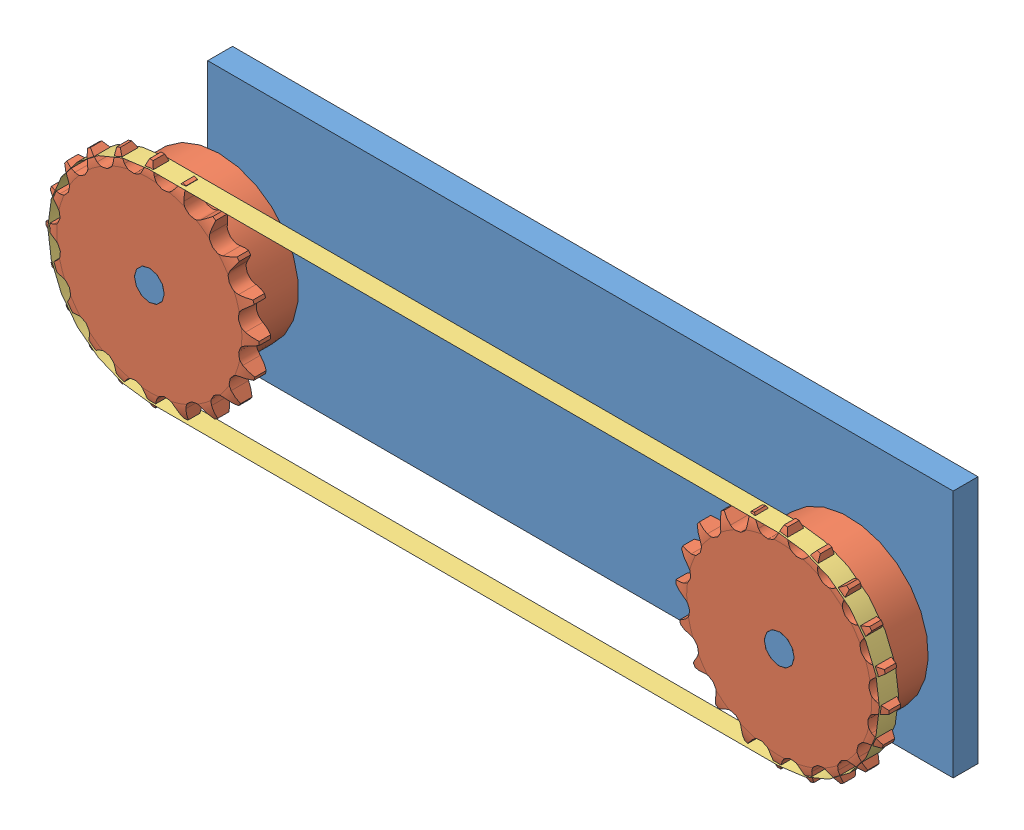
SolidWorks assembly Fertige_Kette_8.SLDASM, configuration Standard (file format 3400). Lengths in mm.
Overall size (368.19 115.57 50.71).
4 component instances, 3 part files, 7 mates.
Components (placement in the parent):
- Grundgeruest_7-1: Grundgeruest_7.SLDPRT [Standard] at (0 0 -10) size (300 100 50)
- madler_105_881_20_Kettenrad_6-1: madler_105_881_20_Kettenrad_6.sldprt [Default] at (16.53 50 40) x (-0.46409 0.885788 0) z (0.885788 0.46409 0) size (85.61 28.71 85.61)
- madler_105_881_20_Kettenrad_6-2: madler_105_881_20_Kettenrad_6.sldprt [Default] at (270 50 40) x (0.905229 0.424924 0) z (0.424924 -0.905229 0) size (85.61 28.71 85.61)
- Riemen8-1: Riemen8.SLDPRT [Standard] at (270 50 36.4) x (-1 0 0) z (0 0 -1) size (334.66 81.19 7.75)
Mates (geometry in assembly coordinates):
- Konzentrisch15: concentric aligned: cylinder of Grundgeruest_7-1; cylinder of madler_105_881_20_Kettenrad_6-1
- Deckungsgleich25: coincident aligned: plane of Grundgeruest_7-1 through (16.53 50 40) normal (0 0 1); plane of madler_105_881_20_Kettenrad_6-1 through (-2.4702 40.0453 40) normal (0 0 1)
- Konzentrisch24: concentric aligned: cylinder of Grundgeruest_7-1; cylinder of madler_105_881_20_Kettenrad_6-2
- Deckungsgleich36: coincident aligned: plane of Grundgeruest_7-1 through (270 50 40) normal (0 0 1); plane of madler_105_881_20_Kettenrad_6-2 through (260.8854 69.4172 40) normal (0 0 1)
- Riemenverknüpfung1: belt = 64 mm: unknown of madler_105_881_20_Kettenrad_6-1; unknown of madler_105_881_20_Kettenrad_6-2
- Deckungsgleich39: coincident: point of Grundgeruest_7-1
- Senkrecht1: perpendicular = 762 mm: unknown of Grundgeruest_7-1
